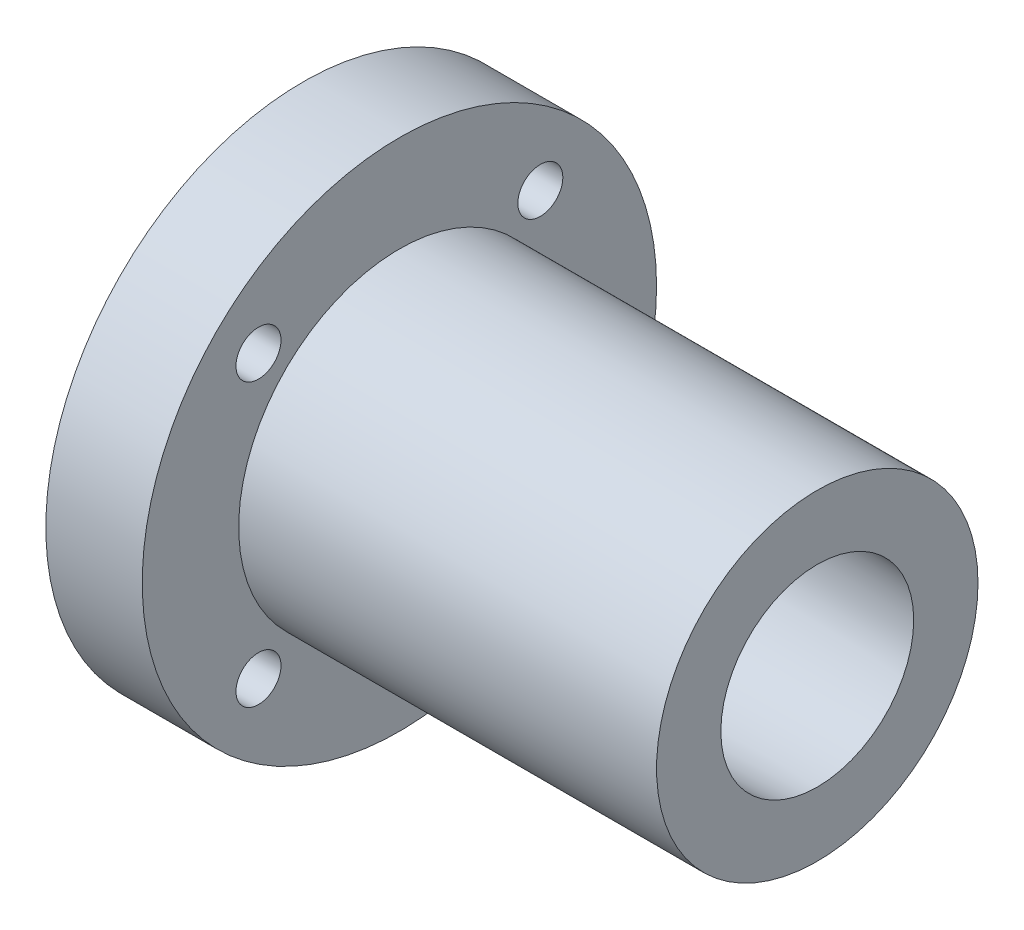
ISO-10303-21;
HEADER;
FILE_DESCRIPTION(('STEP AP214'),'2;1');
FILE_NAME('part.step','',(''),(''),'','','');
FILE_SCHEMA(('AUTOMOTIVE_DESIGN { 1 0 10303 214 1 1 1 1 }'));
ENDSEC;
DATA;
#1=APPLICATION_CONTEXT('core data for automotive mechanical design processes');
#2=APPLICATION_PROTOCOL_DEFINITION('international standard','automotive_design',2000,#1);
#3=PRODUCT_CONTEXT('',#1,'mechanical');
#4=PRODUCT('Part','Part','',(#3));
#5=PRODUCT_RELATED_PRODUCT_CATEGORY('part','',(#4));
#6=PRODUCT_DEFINITION_FORMATION('','',#4);
#7=PRODUCT_DEFINITION_CONTEXT('part definition',#1,'design');
#8=PRODUCT_DEFINITION('design','',#6,#7);
#9=PRODUCT_DEFINITION_SHAPE('','',#8);
#10=(LENGTH_UNIT() NAMED_UNIT(*) SI_UNIT(.MILLI.,.METRE.));
#11=(NAMED_UNIT(*) PLANE_ANGLE_UNIT() SI_UNIT($,.RADIAN.));
#12=(NAMED_UNIT(*) SI_UNIT($,.STERADIAN.) SOLID_ANGLE_UNIT());
#13=UNCERTAINTY_MEASURE_WITH_UNIT(LENGTH_MEASURE(1.E-05),#10,'distance_accuracy_value','');
#14=(GEOMETRIC_REPRESENTATION_CONTEXT(3) GLOBAL_UNCERTAINTY_ASSIGNED_CONTEXT((#13)) GLOBAL_UNIT_ASSIGNED_CONTEXT((#10,
#11,#12)) REPRESENTATION_CONTEXT('',''));
#15=CARTESIAN_POINT('',(0.,0.,0.));
#16=DIRECTION('',(0.,0.,1.));
#17=DIRECTION('',(1.,0.,0.));
#18=AXIS2_PLACEMENT_3D('',#15,#16,#17);
#19=CARTESIAN_POINT('',(0.,40.,0.));
#20=DIRECTION('',(-1.,0.,0.));
#21=DIRECTION('',(0.,0.,1.));
#22=AXIS2_PLACEMENT_3D('',#19,#20,#21);
#23=PLANE('',#22);
#24=CARTESIAN_POINT('',(0.,21.9203102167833,21.9203102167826));
#25=DIRECTION('',(-1.,0.,0.));
#26=DIRECTION('',(0.,0.,1.));
#27=AXIS2_PLACEMENT_3D('',#24,#25,#26);
#28=CIRCLE('',#27,3.49999999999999);
#29=CARTESIAN_POINT('',(0.,21.9203102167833,25.4203102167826));
#30=VERTEX_POINT('',#29);
#31=EDGE_CURVE('E77',#30,#30,#28,.T.);
#32=ORIENTED_EDGE('',*,*,#31,.F.);
#33=EDGE_LOOP('',(#32));
#34=FACE_BOUND('',#33,.T.);
#35=CARTESIAN_POINT('',(0.,-21.9203102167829,21.9203102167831));
#36=DIRECTION('',(-1.,0.,0.));
#37=DIRECTION('',(0.,0.,1.));
#38=AXIS2_PLACEMENT_3D('',#35,#36,#37);
#39=CIRCLE('',#38,3.49999999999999);
#40=CARTESIAN_POINT('',(0.,-21.9203102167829,25.4203102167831));
#41=VERTEX_POINT('',#40);
#42=EDGE_CURVE('E71',#41,#41,#39,.T.);
#43=ORIENTED_EDGE('',*,*,#42,.F.);
#44=EDGE_LOOP('',(#43));
#45=FACE_BOUND('',#44,.T.);
#46=CARTESIAN_POINT('',(0.,-21.9203102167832,-21.9203102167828));
#47=DIRECTION('',(-1.,0.,0.));
#48=DIRECTION('',(0.,0.,1.));
#49=AXIS2_PLACEMENT_3D('',#46,#47,#48);
#50=CIRCLE('',#49,3.49999999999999);
#51=CARTESIAN_POINT('',(0.,-21.9203102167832,-18.4203102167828));
#52=VERTEX_POINT('',#51);
#53=EDGE_CURVE('E65',#52,#52,#50,.T.);
#54=ORIENTED_EDGE('',*,*,#53,.F.);
#55=EDGE_LOOP('',(#54));
#56=FACE_BOUND('',#55,.T.);
#57=CARTESIAN_POINT('',(0.,21.9203102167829,-21.9203102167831));
#58=DIRECTION('',(-1.,0.,0.));
#59=DIRECTION('',(0.,0.,1.));
#60=AXIS2_PLACEMENT_3D('',#57,#58,#59);
#61=CIRCLE('',#60,3.49999999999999);
#62=CARTESIAN_POINT('',(0.,21.9203102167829,-18.4203102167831));
#63=VERTEX_POINT('',#62);
#64=EDGE_CURVE('E59',#63,#63,#61,.T.);
#65=ORIENTED_EDGE('',*,*,#64,.F.);
#66=EDGE_LOOP('',(#65));
#67=FACE_BOUND('',#66,.T.);
#68=CARTESIAN_POINT('',(0.,0.,0.));
#69=DIRECTION('',(1.,0.,0.));
#70=DIRECTION('',(0.,0.,-1.));
#71=AXIS2_PLACEMENT_3D('',#68,#69,#70);
#72=CIRCLE('',#71,18.);
#73=CARTESIAN_POINT('',(0.,0.,-18.));
#74=VERTEX_POINT('',#73);
#75=EDGE_CURVE('E53',#74,#74,#72,.T.);
#76=ORIENTED_EDGE('',*,*,#75,.T.);
#77=EDGE_LOOP('',(#76));
#78=FACE_BOUND('',#77,.T.);
#79=CARTESIAN_POINT('',(0.,0.,0.));
#80=DIRECTION('',(1.,0.,0.));
#81=DIRECTION('',(0.,0.,-1.));
#82=AXIS2_PLACEMENT_3D('',#79,#80,#81);
#83=CIRCLE('',#82,40.);
#84=CARTESIAN_POINT('',(0.,0.,-40.));
#85=VERTEX_POINT('',#84);
#86=EDGE_CURVE('E45',#85,#85,#83,.T.);
#87=ORIENTED_EDGE('',*,*,#86,.F.);
#88=EDGE_LOOP('',(#87));
#89=FACE_BOUND('',#88,.T.);
#90=ADVANCED_FACE('F31',(#34,#45,#56,#67,#78,#89),#23,.T.);
#91=CARTESIAN_POINT('',(80.,0.,0.));
#92=DIRECTION('',(1.,0.,0.));
#93=DIRECTION('',(0.,0.,-1.));
#94=AXIS2_PLACEMENT_3D('',#91,#92,#93);
#95=PLANE('',#94);
#96=CARTESIAN_POINT('',(80.,0.,0.));
#97=DIRECTION('',(1.,0.,0.));
#98=DIRECTION('',(0.,0.,-1.));
#99=AXIS2_PLACEMENT_3D('',#96,#97,#98);
#100=CIRCLE('',#99,15.);
#101=CARTESIAN_POINT('',(80.,0.,-15.));
#102=VERTEX_POINT('',#101);
#103=EDGE_CURVE('E50',#102,#102,#100,.T.);
#104=ORIENTED_EDGE('',*,*,#103,.F.);
#105=EDGE_LOOP('',(#104));
#106=FACE_BOUND('',#105,.T.);
#107=CARTESIAN_POINT('',(80.,0.,0.));
#108=DIRECTION('',(1.,0.,0.));
#109=DIRECTION('',(0.,0.,-1.));
#110=AXIS2_PLACEMENT_3D('',#107,#108,#109);
#111=CIRCLE('',#110,25.);
#112=CARTESIAN_POINT('',(80.,0.,-25.));
#113=VERTEX_POINT('',#112);
#114=EDGE_CURVE('E10',#113,#113,#111,.T.);
#115=ORIENTED_EDGE('',*,*,#114,.T.);
#116=EDGE_LOOP('',(#115));
#117=FACE_BOUND('',#116,.T.);
#118=ADVANCED_FACE('F86',(#106,#117),#95,.T.);
#119=CARTESIAN_POINT('',(0.,0.,0.));
#120=DIRECTION('',(1.,0.,0.));
#121=DIRECTION('',(0.,0.,-1.));
#122=AXIS2_PLACEMENT_3D('',#119,#120,#121);
#123=CYLINDRICAL_SURFACE('',#122,25.);
#124=CARTESIAN_POINT('',(15.,0.,0.));
#125=DIRECTION('',(1.,0.,0.));
#126=DIRECTION('',(0.,0.,-1.));
#127=AXIS2_PLACEMENT_3D('',#124,#125,#126);
#128=CIRCLE('',#127,25.);
#129=CARTESIAN_POINT('',(15.,0.,-25.));
#130=VERTEX_POINT('',#129);
#131=EDGE_CURVE('E37',#130,#130,#128,.T.);
#132=ORIENTED_EDGE('',*,*,#131,.T.);
#133=EDGE_LOOP('',(#132));
#134=FACE_BOUND('',#133,.T.);
#135=ORIENTED_EDGE('',*,*,#114,.F.);
#136=EDGE_LOOP('',(#135));
#137=FACE_BOUND('',#136,.T.);
#138=ADVANCED_FACE('F107',(#134,#137),#123,.T.);
#139=CARTESIAN_POINT('',(15.,25.,0.));
#140=DIRECTION('',(1.,0.,0.));
#141=DIRECTION('',(0.,0.,-1.));
#142=AXIS2_PLACEMENT_3D('',#139,#140,#141);
#143=PLANE('',#142);
#144=CARTESIAN_POINT('',(15.,21.9203102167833,21.9203102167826));
#145=DIRECTION('',(1.,0.,0.));
#146=DIRECTION('',(0.,0.,-1.));
#147=AXIS2_PLACEMENT_3D('',#144,#145,#146);
#148=CIRCLE('',#147,3.49999999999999);
#149=CARTESIAN_POINT('',(15.,21.9203102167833,18.4203102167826));
#150=VERTEX_POINT('',#149);
#151=EDGE_CURVE('E74',#150,#150,#148,.T.);
#152=ORIENTED_EDGE('',*,*,#151,.F.);
#153=EDGE_LOOP('',(#152));
#154=FACE_BOUND('',#153,.T.);
#155=CARTESIAN_POINT('',(15.,-21.9203102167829,21.9203102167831));
#156=DIRECTION('',(1.,0.,0.));
#157=DIRECTION('',(0.,0.,-1.));
#158=AXIS2_PLACEMENT_3D('',#155,#156,#157);
#159=CIRCLE('',#158,3.49999999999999);
#160=CARTESIAN_POINT('',(15.,-21.9203102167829,18.4203102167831));
#161=VERTEX_POINT('',#160);
#162=EDGE_CURVE('E68',#161,#161,#159,.T.);
#163=ORIENTED_EDGE('',*,*,#162,.F.);
#164=EDGE_LOOP('',(#163));
#165=FACE_BOUND('',#164,.T.);
#166=CARTESIAN_POINT('',(15.,-21.9203102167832,-21.9203102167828));
#167=DIRECTION('',(1.,0.,0.));
#168=DIRECTION('',(0.,0.,-1.));
#169=AXIS2_PLACEMENT_3D('',#166,#167,#168);
#170=CIRCLE('',#169,3.49999999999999);
#171=CARTESIAN_POINT('',(15.,-21.9203102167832,-25.4203102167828));
#172=VERTEX_POINT('',#171);
#173=EDGE_CURVE('E62',#172,#172,#170,.T.);
#174=ORIENTED_EDGE('',*,*,#173,.F.);
#175=EDGE_LOOP('',(#174));
#176=FACE_BOUND('',#175,.T.);
#177=CARTESIAN_POINT('',(15.,21.9203102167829,-21.9203102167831));
#178=DIRECTION('',(1.,0.,0.));
#179=DIRECTION('',(0.,0.,-1.));
#180=AXIS2_PLACEMENT_3D('',#177,#178,#179);
#181=CIRCLE('',#180,3.49999999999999);
#182=CARTESIAN_POINT('',(15.,21.9203102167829,-25.4203102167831));
#183=VERTEX_POINT('',#182);
#184=EDGE_CURVE('E56',#183,#183,#181,.T.);
#185=ORIENTED_EDGE('',*,*,#184,.F.);
#186=EDGE_LOOP('',(#185));
#187=FACE_BOUND('',#186,.T.);
#188=CARTESIAN_POINT('',(15.,0.,0.));
#189=DIRECTION('',(1.,0.,0.));
#190=DIRECTION('',(0.,0.,-1.));
#191=AXIS2_PLACEMENT_3D('',#188,#189,#190);
#192=CIRCLE('',#191,40.);
#193=CARTESIAN_POINT('',(15.,0.,-40.));
#194=VERTEX_POINT('',#193);
#195=EDGE_CURVE('E41',#194,#194,#192,.T.);
#196=ORIENTED_EDGE('',*,*,#195,.T.);
#197=EDGE_LOOP('',(#196));
#198=FACE_BOUND('',#197,.T.);
#199=ORIENTED_EDGE('',*,*,#131,.F.);
#200=EDGE_LOOP('',(#199));
#201=FACE_BOUND('',#200,.T.);
#202=ADVANCED_FACE('F101',(#154,#165,#176,#187,#198,#201),#143,.T.);
#203=CARTESIAN_POINT('',(0.,0.,0.));
#204=DIRECTION('',(1.,0.,0.));
#205=DIRECTION('',(0.,0.,-1.));
#206=AXIS2_PLACEMENT_3D('',#203,#204,#205);
#207=CYLINDRICAL_SURFACE('',#206,40.);
#208=ORIENTED_EDGE('',*,*,#86,.T.);
#209=EDGE_LOOP('',(#208));
#210=FACE_BOUND('',#209,.T.);
#211=ORIENTED_EDGE('',*,*,#195,.F.);
#212=EDGE_LOOP('',(#211));
#213=FACE_BOUND('',#212,.T.);
#214=ADVANCED_FACE('F97',(#210,#213),#207,.T.);
#215=CARTESIAN_POINT('',(80.,0.,0.));
#216=DIRECTION('',(-1.,0.,0.));
#217=DIRECTION('',(0.,0.,1.));
#218=AXIS2_PLACEMENT_3D('',#215,#216,#217);
#219=CONICAL_SURFACE('',#218,15.,0.0374824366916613);
#220=ORIENTED_EDGE('',*,*,#75,.F.);
#221=EDGE_LOOP('',(#220));
#222=FACE_BOUND('',#221,.T.);
#223=ORIENTED_EDGE('',*,*,#103,.T.);
#224=EDGE_LOOP('',(#223));
#225=FACE_BOUND('',#224,.T.);
#226=ADVANCED_FACE('F100',(#222,#225),#219,.F.);
#227=CARTESIAN_POINT('',(0.,21.9203102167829,-21.9203102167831));
#228=DIRECTION('',(-1.,0.,0.));
#229=DIRECTION('',(0.,0.,1.));
#230=AXIS2_PLACEMENT_3D('',#227,#228,#229);
#231=CYLINDRICAL_SURFACE('',#230,3.49999999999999);
#232=ORIENTED_EDGE('',*,*,#64,.T.);
#233=EDGE_LOOP('',(#232));
#234=FACE_BOUND('',#233,.T.);
#235=ORIENTED_EDGE('',*,*,#184,.T.);
#236=EDGE_LOOP('',(#235));
#237=FACE_BOUND('',#236,.T.);
#238=ADVANCED_FACE('F127',(#234,#237),#231,.F.);
#239=CARTESIAN_POINT('',(0.,-21.9203102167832,-21.9203102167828));
#240=DIRECTION('',(-1.,0.,0.));
#241=DIRECTION('',(0.,0.,1.));
#242=AXIS2_PLACEMENT_3D('',#239,#240,#241);
#243=CYLINDRICAL_SURFACE('',#242,3.49999999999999);
#244=ORIENTED_EDGE('',*,*,#53,.T.);
#245=EDGE_LOOP('',(#244));
#246=FACE_BOUND('',#245,.T.);
#247=ORIENTED_EDGE('',*,*,#173,.T.);
#248=EDGE_LOOP('',(#247));
#249=FACE_BOUND('',#248,.T.);
#250=ADVANCED_FACE('F131',(#246,#249),#243,.F.);
#251=CARTESIAN_POINT('',(0.,-21.9203102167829,21.9203102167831));
#252=DIRECTION('',(-1.,0.,0.));
#253=DIRECTION('',(0.,0.,1.));
#254=AXIS2_PLACEMENT_3D('',#251,#252,#253);
#255=CYLINDRICAL_SURFACE('',#254,3.49999999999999);
#256=ORIENTED_EDGE('',*,*,#42,.T.);
#257=EDGE_LOOP('',(#256));
#258=FACE_BOUND('',#257,.T.);
#259=ORIENTED_EDGE('',*,*,#162,.T.);
#260=EDGE_LOOP('',(#259));
#261=FACE_BOUND('',#260,.T.);
#262=ADVANCED_FACE('F137',(#258,#261),#255,.F.);
#263=CARTESIAN_POINT('',(0.,21.9203102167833,21.9203102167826));
#264=DIRECTION('',(-1.,0.,0.));
#265=DIRECTION('',(0.,0.,1.));
#266=AXIS2_PLACEMENT_3D('',#263,#264,#265);
#267=CYLINDRICAL_SURFACE('',#266,3.49999999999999);
#268=ORIENTED_EDGE('',*,*,#31,.T.);
#269=EDGE_LOOP('',(#268));
#270=FACE_BOUND('',#269,.T.);
#271=ORIENTED_EDGE('',*,*,#151,.T.);
#272=EDGE_LOOP('',(#271));
#273=FACE_BOUND('',#272,.T.);
#274=ADVANCED_FACE('F81',(#270,#273),#267,.F.);
#275=CLOSED_SHELL('',(#90,#118,#138,#202,#214,#226,#238,#250,#262,#274));
#276=MANIFOLD_SOLID_BREP('B2',#275);
#277=ADVANCED_BREP_SHAPE_REPRESENTATION('',(#18,#276),#14);
#278=SHAPE_DEFINITION_REPRESENTATION(#9,#277);
ENDSEC;
END-ISO-10303-21;
